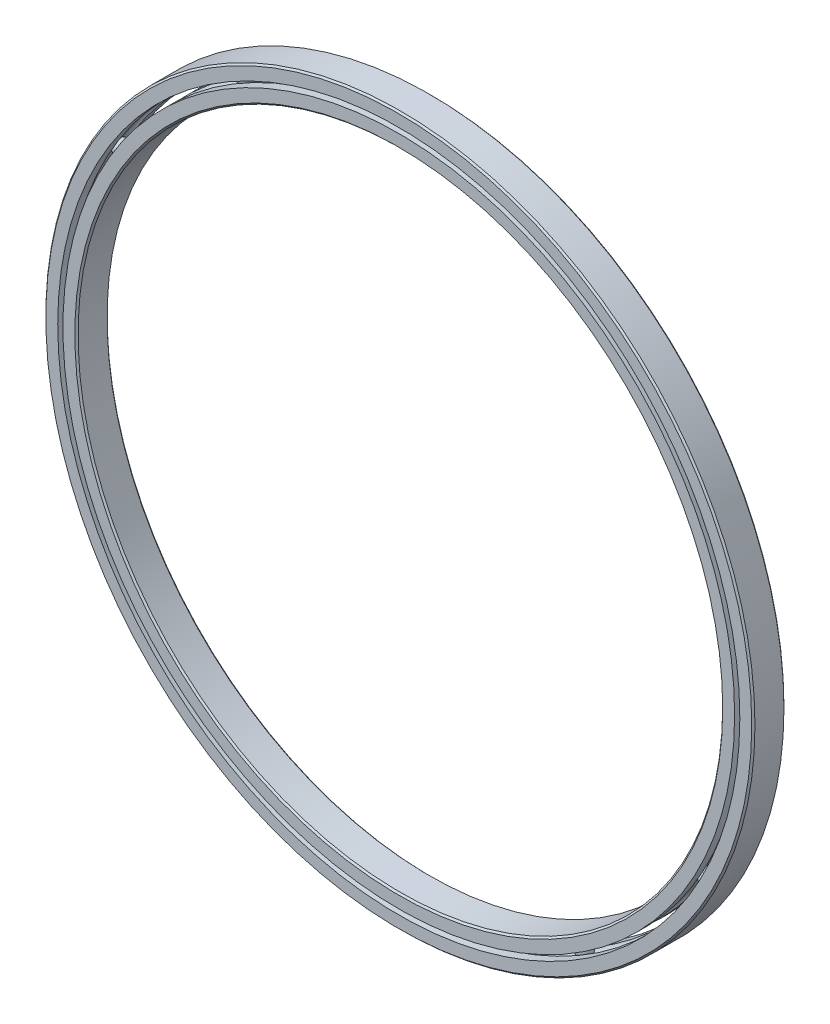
from build123d import *

# Parameters (mm, degrees)
CIRPATTERN1_COUNT = 12


with BuildPart() as part:
    # Sketch1 → Revolve1 (revolve)
    with BuildSketch(Plane(origin=(0, 0, 0), x_dir=(0, 0, -1), z_dir=(1, 0, 0)), mode=Mode.PRIVATE) as revolve1_sk:
        with BuildLine():
            Line((2.8575, 69.85), (-2.8575, 69.85))
            Line((-2.8575, 69.85), (-3.175, 69.5325))
            Line((-3.175, 69.5325), (-3.175, 67.187884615))
            Line((-3.175, 67.187884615), (-1.411111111, 67.187884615))
            ThreePointArc((-1.411111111, 67.187884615), (0, 68.176427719), (1.411111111, 67.187884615))
            Line((1.411111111, 67.187884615), (3.175, 67.187884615))
            Line((3.175, 67.187884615), (3.175, 69.5325))
            Line((3.175, 69.5325), (2.8575, 69.85))
        make_face()
    revolve(revolve1_sk.sketch.rotate(Axis((0, 0, 3.175), (0, 0, -1)), 90), axis=Axis((0, 0, 3.175), (0, 0, -1)))


with BuildPart() as body_2:
    # Sketch3 → Revolve3 (revolve)
    with BuildSketch(Plane(origin=(0, 0, 0), x_dir=(0, 0, -1), z_dir=(1, 0, 0)), mode=Mode.PRIVATE) as revolve3_sk:
        with BuildLine():
            Line((-3.175, 66.162115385), (-1.411111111, 66.162115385))
            ThreePointArc((-1.411111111, 66.162115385), (0, 65.173572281), (1.411111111, 66.162115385))
            Line((1.411111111, 66.162115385), (3.175, 66.162115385))
            Line((3.175, 66.162115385), (3.175, 63.8175))
            Line((3.175, 63.8175), (2.8575, 63.5))
            Line((2.8575, 63.5), (-2.8575, 63.5))
            Line((-2.8575, 63.5), (-3.175, 63.8175))
            Line((-3.175, 63.8175), (-3.175, 66.162115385))
        make_face()
    revolve(revolve3_sk.sketch.rotate(Axis((0, 0, 3.175), (0, 0, -1)), 90), axis=Axis((0, 0, 3.175), (0, 0, -1)))


with BuildPart() as body_3:
    # Sketch4 → Revolve4 (revolve)
    with BuildSketch(Plane(origin=(0, 0, 0), x_dir=(0, 0, -1), z_dir=(1, 0, 0))):
        with BuildLine():
            Line((-1.501427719, 66.675), (1.501427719, 66.675))
            ThreePointArc((1.501427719, 66.675), (0, 68.176427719), (-1.501427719, 66.675))
        make_face()
    revolve(axis=Axis((0, 66.675, 1.501427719), (0, 0, -1)))


with BuildPart() as cirpattern1_1:
    # CirPattern1: pattern copy
    add(body_3.part.rotate(Axis((0, 0, 0), (0, 0, 1)), 1 * 360 / CIRPATTERN1_COUNT))


with BuildPart() as cirpattern1_2:
    # CirPattern1: pattern copy
    add(body_3.part.rotate(Axis((0, 0, 0), (0, 0, 1)), 2 * 360 / CIRPATTERN1_COUNT))


with BuildPart() as cirpattern1_3:
    # CirPattern1: pattern copy
    add(body_3.part.rotate(Axis((0, 0, 0), (0, 0, 1)), 3 * 360 / CIRPATTERN1_COUNT))


with BuildPart() as cirpattern1_4:
    # CirPattern1: pattern copy
    add(body_3.part.rotate(Axis((0, 0, 0), (0, 0, 1)), 4 * 360 / CIRPATTERN1_COUNT))


with BuildPart() as cirpattern1_5:
    # CirPattern1: pattern copy
    add(body_3.part.rotate(Axis((0, 0, 0), (0, 0, 1)), 5 * 360 / CIRPATTERN1_COUNT))


with BuildPart() as cirpattern1_6:
    # CirPattern1: pattern copy
    add(body_3.part.rotate(Axis((0, 0, 0), (0, 0, 1)), 6 * 360 / CIRPATTERN1_COUNT))


with BuildPart() as cirpattern1_7:
    # CirPattern1: pattern copy
    add(body_3.part.rotate(Axis((0, 0, 0), (0, 0, 1)), 7 * 360 / CIRPATTERN1_COUNT))


with BuildPart() as cirpattern1_8:
    # CirPattern1: pattern copy
    add(body_3.part.rotate(Axis((0, 0, 0), (0, 0, 1)), 8 * 360 / CIRPATTERN1_COUNT))


with BuildPart() as cirpattern1_9:
    # CirPattern1: pattern copy
    add(body_3.part.rotate(Axis((0, 0, 0), (0, 0, 1)), 9 * 360 / CIRPATTERN1_COUNT))


with BuildPart() as cirpattern1_10:
    # CirPattern1: pattern copy
    add(body_3.part.rotate(Axis((0, 0, 0), (0, 0, 1)), 10 * 360 / CIRPATTERN1_COUNT))


with BuildPart() as cirpattern1_11:
    # CirPattern1: pattern copy
    add(body_3.part.rotate(Axis((0, 0, 0), (0, 0, 1)), 11 * 360 / CIRPATTERN1_COUNT))


solid = Compound([part.part, body_2.part, body_3.part, cirpattern1_1.part, cirpattern1_2.part, cirpattern1_3.part, cirpattern1_4.part, cirpattern1_5.part, cirpattern1_6.part, cirpattern1_7.part, cirpattern1_8.part, cirpattern1_9.part, cirpattern1_10.part, cirpattern1_11.part])
